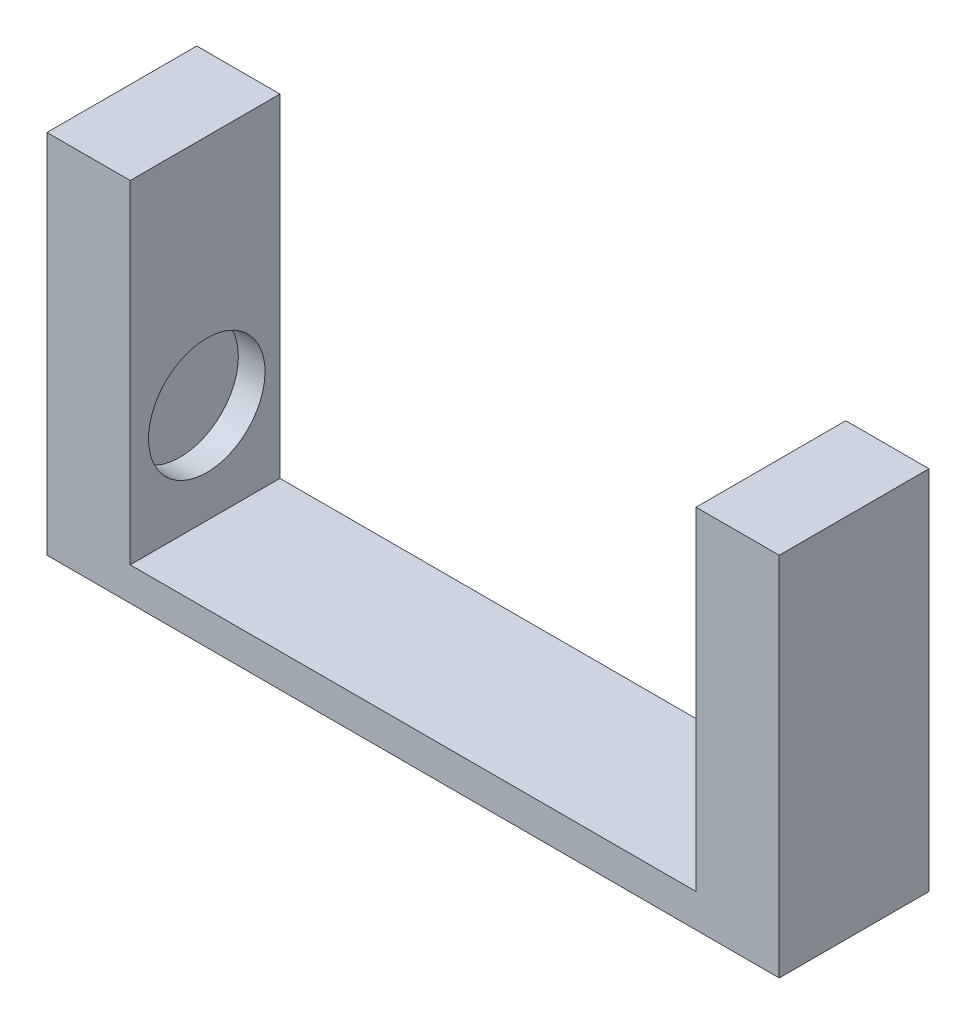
ISO-10303-21;
HEADER;
FILE_DESCRIPTION(('STEP AP214'),'2;1');
FILE_NAME('part.step','',(''),(''),'','','');
FILE_SCHEMA(('AUTOMOTIVE_DESIGN { 1 0 10303 214 1 1 1 1 }'));
ENDSEC;
DATA;
#1=APPLICATION_CONTEXT('core data for automotive mechanical design processes');
#2=APPLICATION_PROTOCOL_DEFINITION('international standard','automotive_design',2000,#1);
#3=PRODUCT_CONTEXT('',#1,'mechanical');
#4=PRODUCT('Part','Part','',(#3));
#5=PRODUCT_RELATED_PRODUCT_CATEGORY('part','',(#4));
#6=PRODUCT_DEFINITION_FORMATION('','',#4);
#7=PRODUCT_DEFINITION_CONTEXT('part definition',#1,'design');
#8=PRODUCT_DEFINITION('design','',#6,#7);
#9=PRODUCT_DEFINITION_SHAPE('','',#8);
#10=(LENGTH_UNIT() NAMED_UNIT(*) SI_UNIT(.MILLI.,.METRE.));
#11=(NAMED_UNIT(*) PLANE_ANGLE_UNIT() SI_UNIT($,.RADIAN.));
#12=(NAMED_UNIT(*) SI_UNIT($,.STERADIAN.) SOLID_ANGLE_UNIT());
#13=UNCERTAINTY_MEASURE_WITH_UNIT(LENGTH_MEASURE(1.E-05),#10,'distance_accuracy_value','');
#14=(GEOMETRIC_REPRESENTATION_CONTEXT(3) GLOBAL_UNCERTAINTY_ASSIGNED_CONTEXT((#13)) GLOBAL_UNIT_ASSIGNED_CONTEXT((#10,
#11,#12)) REPRESENTATION_CONTEXT('',''));
#15=CARTESIAN_POINT('',(0.,0.,0.));
#16=DIRECTION('',(0.,0.,1.));
#17=DIRECTION('',(1.,0.,0.));
#18=AXIS2_PLACEMENT_3D('',#15,#16,#17);
#19=CARTESIAN_POINT('',(0.,110.,45.));
#20=DIRECTION('',(0.,-1.,0.));
#21=DIRECTION('',(0.,0.,-1.));
#22=AXIS2_PLACEMENT_3D('',#19,#20,#21);
#23=PLANE('',#22);
#24=DIRECTION('',(-1.,0.,0.));
#25=VECTOR('',#24,1.);
#26=CARTESIAN_POINT('',(0.,110.,45.));
#27=LINE('',#26,#25);
#28=CARTESIAN_POINT('',(25.,110.,45.));
#29=VERTEX_POINT('',#28);
#30=CARTESIAN_POINT('',(0.,110.,45.));
#31=VERTEX_POINT('',#30);
#32=EDGE_CURVE('E56',#29,#31,#27,.T.);
#33=ORIENTED_EDGE('',*,*,#32,.F.);
#34=DIRECTION('',(0.,0.,1.));
#35=VECTOR('',#34,1.);
#36=CARTESIAN_POINT('',(25.,110.,-20.));
#37=LINE('',#36,#35);
#38=CARTESIAN_POINT('',(25.,110.,0.));
#39=VERTEX_POINT('',#38);
#40=EDGE_CURVE('E119',#39,#29,#37,.T.);
#41=ORIENTED_EDGE('',*,*,#40,.F.);
#42=DIRECTION('',(-1.,0.,0.));
#43=VECTOR('',#42,1.);
#44=CARTESIAN_POINT('',(0.,110.,0.));
#45=LINE('',#44,#43);
#46=CARTESIAN_POINT('',(0.,110.,0.));
#47=VERTEX_POINT('',#46);
#48=EDGE_CURVE('E78',#39,#47,#45,.T.);
#49=ORIENTED_EDGE('',*,*,#48,.T.);
#50=DIRECTION('',(0.,0.,-1.));
#51=VECTOR('',#50,1.);
#52=CARTESIAN_POINT('',(0.,110.,45.));
#53=LINE('',#52,#51);
#54=EDGE_CURVE('E142',#31,#47,#53,.T.);
#55=ORIENTED_EDGE('',*,*,#54,.F.);
#56=EDGE_LOOP('',(#33,#41,#49,#55));
#57=FACE_BOUND('',#56,.T.);
#58=ADVANCED_FACE('F32',(#57),#23,.F.);
#59=CARTESIAN_POINT('',(0.,0.,45.));
#60=DIRECTION('',(1.,0.,0.));
#61=DIRECTION('',(0.,0.,-1.));
#62=AXIS2_PLACEMENT_3D('',#59,#60,#61);
#63=PLANE('',#62);
#64=DIRECTION('',(0.,-1.,0.));
#65=VECTOR('',#64,1.);
#66=CARTESIAN_POINT('',(0.,0.,0.));
#67=LINE('',#66,#65);
#68=CARTESIAN_POINT('',(0.,0.,0.));
#69=VERTEX_POINT('',#68);
#70=EDGE_CURVE('E129',#47,#69,#67,.T.);
#71=ORIENTED_EDGE('',*,*,#70,.T.);
#72=DIRECTION('',(0.,0.,-1.));
#73=VECTOR('',#72,1.);
#74=CARTESIAN_POINT('',(0.,0.,45.));
#75=LINE('',#74,#73);
#76=CARTESIAN_POINT('',(0.,0.,45.));
#77=VERTEX_POINT('',#76);
#78=EDGE_CURVE('E158',#77,#69,#75,.T.);
#79=ORIENTED_EDGE('',*,*,#78,.F.);
#80=DIRECTION('',(0.,-1.,0.));
#81=VECTOR('',#80,1.);
#82=CARTESIAN_POINT('',(0.,0.,45.));
#83=LINE('',#82,#81);
#84=EDGE_CURVE('E134',#31,#77,#83,.T.);
#85=ORIENTED_EDGE('',*,*,#84,.F.);
#86=ORIENTED_EDGE('',*,*,#54,.T.);
#87=EDGE_LOOP('',(#71,#79,#85,#86));
#88=FACE_BOUND('',#87,.T.);
#89=ADVANCED_FACE('F34',(#88),#63,.F.);
#90=CARTESIAN_POINT('',(0.,0.,45.));
#91=DIRECTION('',(0.,1.,0.));
#92=DIRECTION('',(0.,0.,1.));
#93=AXIS2_PLACEMENT_3D('',#90,#91,#92);
#94=PLANE('',#93);
#95=DIRECTION('',(1.,0.,0.));
#96=VECTOR('',#95,1.);
#97=CARTESIAN_POINT('',(0.,0.,0.));
#98=LINE('',#97,#96);
#99=CARTESIAN_POINT('',(220.,0.,0.));
#100=VERTEX_POINT('',#99);
#101=EDGE_CURVE('E145',#69,#100,#98,.T.);
#102=ORIENTED_EDGE('',*,*,#101,.T.);
#103=DIRECTION('',(0.,0.,-1.));
#104=VECTOR('',#103,1.);
#105=CARTESIAN_POINT('',(220.,0.,45.));
#106=LINE('',#105,#104);
#107=CARTESIAN_POINT('',(220.,0.,45.));
#108=VERTEX_POINT('',#107);
#109=EDGE_CURVE('E155',#108,#100,#106,.T.);
#110=ORIENTED_EDGE('',*,*,#109,.F.);
#111=DIRECTION('',(1.,0.,0.));
#112=VECTOR('',#111,1.);
#113=CARTESIAN_POINT('',(0.,0.,45.));
#114=LINE('',#113,#112);
#115=EDGE_CURVE('E86',#77,#108,#114,.T.);
#116=ORIENTED_EDGE('',*,*,#115,.F.);
#117=ORIENTED_EDGE('',*,*,#78,.T.);
#118=EDGE_LOOP('',(#102,#110,#116,#117));
#119=FACE_BOUND('',#118,.T.);
#120=ADVANCED_FACE('F172',(#119),#94,.F.);
#121=CARTESIAN_POINT('',(220.,0.,45.));
#122=DIRECTION('',(-1.,0.,0.));
#123=DIRECTION('',(0.,0.,1.));
#124=AXIS2_PLACEMENT_3D('',#121,#122,#123);
#125=PLANE('',#124);
#126=DIRECTION('',(0.,1.,0.));
#127=VECTOR('',#126,1.);
#128=CARTESIAN_POINT('',(220.,0.,0.));
#129=LINE('',#128,#127);
#130=CARTESIAN_POINT('',(220.,110.,0.));
#131=VERTEX_POINT('',#130);
#132=EDGE_CURVE('E147',#100,#131,#129,.T.);
#133=ORIENTED_EDGE('',*,*,#132,.T.);
#134=DIRECTION('',(0.,0.,-1.));
#135=VECTOR('',#134,1.);
#136=CARTESIAN_POINT('',(220.,110.,45.));
#137=LINE('',#136,#135);
#138=CARTESIAN_POINT('',(220.,110.,45.));
#139=VERTEX_POINT('',#138);
#140=EDGE_CURVE('E152',#139,#131,#137,.T.);
#141=ORIENTED_EDGE('',*,*,#140,.F.);
#142=DIRECTION('',(0.,1.,0.));
#143=VECTOR('',#142,1.);
#144=CARTESIAN_POINT('',(220.,0.,45.));
#145=LINE('',#144,#143);
#146=EDGE_CURVE('E138',#108,#139,#145,.T.);
#147=ORIENTED_EDGE('',*,*,#146,.F.);
#148=ORIENTED_EDGE('',*,*,#109,.T.);
#149=EDGE_LOOP('',(#133,#141,#147,#148));
#150=FACE_BOUND('',#149,.T.);
#151=ADVANCED_FACE('F175',(#150),#125,.F.);
#152=CARTESIAN_POINT('',(195.,110.,0.));
#153=VERTEX_POINT('',#152);
#154=EDGE_CURVE('E136',#131,#153,#45,.T.);
#155=ORIENTED_EDGE('',*,*,#154,.T.);
#156=DIRECTION('',(0.,0.,1.));
#157=VECTOR('',#156,1.);
#158=CARTESIAN_POINT('',(195.,110.,-20.));
#159=LINE('',#158,#157);
#160=CARTESIAN_POINT('',(195.,110.,45.));
#161=VERTEX_POINT('',#160);
#162=EDGE_CURVE('E130',#153,#161,#159,.T.);
#163=ORIENTED_EDGE('',*,*,#162,.T.);
#164=EDGE_CURVE('E140',#139,#161,#27,.T.);
#165=ORIENTED_EDGE('',*,*,#164,.F.);
#166=ORIENTED_EDGE('',*,*,#140,.T.);
#167=EDGE_LOOP('',(#155,#163,#165,#166));
#168=FACE_BOUND('',#167,.T.);
#169=ADVANCED_FACE('F178',(#168),#23,.F.);
#170=CARTESIAN_POINT('',(0.,110.,45.));
#171=DIRECTION('',(0.,0.,-1.));
#172=DIRECTION('',(-1.,0.,0.));
#173=AXIS2_PLACEMENT_3D('',#170,#171,#172);
#174=PLANE('',#173);
#175=DIRECTION('',(1.,0.,0.));
#176=VECTOR('',#175,1.);
#177=CARTESIAN_POINT('',(25.,10.,45.));
#178=LINE('',#177,#176);
#179=CARTESIAN_POINT('',(25.,10.,45.));
#180=VERTEX_POINT('',#179);
#181=CARTESIAN_POINT('',(195.,9.99999999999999,45.));
#182=VERTEX_POINT('',#181);
#183=EDGE_CURVE('E109',#180,#182,#178,.T.);
#184=ORIENTED_EDGE('',*,*,#183,.F.);
#185=DIRECTION('',(0.,-1.,0.));
#186=VECTOR('',#185,1.);
#187=CARTESIAN_POINT('',(25.,110.,45.));
#188=LINE('',#187,#186);
#189=EDGE_CURVE('E117',#29,#180,#188,.T.);
#190=ORIENTED_EDGE('',*,*,#189,.F.);
#191=ORIENTED_EDGE('',*,*,#32,.T.);
#192=ORIENTED_EDGE('',*,*,#84,.T.);
#193=ORIENTED_EDGE('',*,*,#115,.T.);
#194=ORIENTED_EDGE('',*,*,#146,.T.);
#195=ORIENTED_EDGE('',*,*,#164,.T.);
#196=DIRECTION('',(0.,1.,0.));
#197=VECTOR('',#196,1.);
#198=CARTESIAN_POINT('',(195.,110.,45.));
#199=LINE('',#198,#197);
#200=EDGE_CURVE('E115',#182,#161,#199,.T.);
#201=ORIENTED_EDGE('',*,*,#200,.F.);
#202=EDGE_LOOP('',(#184,#190,#191,#192,#193,#194,#195,#201));
#203=FACE_BOUND('',#202,.T.);
#204=ADVANCED_FACE('F122',(#203),#174,.F.);
#205=CARTESIAN_POINT('',(0.,110.,0.));
#206=DIRECTION('',(0.,0.,-1.));
#207=DIRECTION('',(-1.,0.,0.));
#208=AXIS2_PLACEMENT_3D('',#205,#206,#207);
#209=PLANE('',#208);
#210=DIRECTION('',(0.,1.,0.));
#211=VECTOR('',#210,1.);
#212=CARTESIAN_POINT('',(25.,110.,0.));
#213=LINE('',#212,#211);
#214=CARTESIAN_POINT('',(25.,10.,0.));
#215=VERTEX_POINT('',#214);
#216=EDGE_CURVE('E11',#215,#39,#213,.T.);
#217=ORIENTED_EDGE('',*,*,#216,.F.);
#218=DIRECTION('',(-1.,0.,0.));
#219=VECTOR('',#218,1.);
#220=CARTESIAN_POINT('',(0.,9.99999999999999,0.));
#221=LINE('',#220,#219);
#222=CARTESIAN_POINT('',(195.,9.99999999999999,0.));
#223=VERTEX_POINT('',#222);
#224=EDGE_CURVE('E112',#223,#215,#221,.T.);
#225=ORIENTED_EDGE('',*,*,#224,.F.);
#226=DIRECTION('',(0.,-1.,0.));
#227=VECTOR('',#226,1.);
#228=CARTESIAN_POINT('',(195.,110.,0.));
#229=LINE('',#228,#227);
#230=EDGE_CURVE('E40',#153,#223,#229,.T.);
#231=ORIENTED_EDGE('',*,*,#230,.F.);
#232=ORIENTED_EDGE('',*,*,#154,.F.);
#233=ORIENTED_EDGE('',*,*,#132,.F.);
#234=ORIENTED_EDGE('',*,*,#101,.F.);
#235=ORIENTED_EDGE('',*,*,#70,.F.);
#236=ORIENTED_EDGE('',*,*,#48,.F.);
#237=EDGE_LOOP('',(#217,#225,#231,#232,#233,#234,#235,#236));
#238=FACE_BOUND('',#237,.T.);
#239=ADVANCED_FACE('F165',(#238),#209,.T.);
#240=CARTESIAN_POINT('',(25.,110.,-20.));
#241=DIRECTION('',(-1.,0.,0.));
#242=DIRECTION('',(0.,-1.,0.));
#243=AXIS2_PLACEMENT_3D('',#240,#241,#242);
#244=PLANE('',#243);
#245=CARTESIAN_POINT('',(25.,40.,22.));
#246=DIRECTION('',(1.,0.,0.));
#247=DIRECTION('',(0.,1.,0.));
#248=AXIS2_PLACEMENT_3D('',#245,#246,#247);
#249=CIRCLE('',#248,17.5);
#250=CARTESIAN_POINT('',(25.,57.5,22.));
#251=VERTEX_POINT('',#250);
#252=EDGE_CURVE('E296',#251,#251,#249,.T.);
#253=ORIENTED_EDGE('',*,*,#252,.F.);
#254=EDGE_LOOP('',(#253));
#255=FACE_BOUND('',#254,.T.);
#256=ORIENTED_EDGE('',*,*,#216,.T.);
#257=ORIENTED_EDGE('',*,*,#40,.T.);
#258=ORIENTED_EDGE('',*,*,#189,.T.);
#259=DIRECTION('',(0.,0.,1.));
#260=VECTOR('',#259,1.);
#261=CARTESIAN_POINT('',(25.,10.,-20.));
#262=LINE('',#261,#260);
#263=EDGE_CURVE('E105',#215,#180,#262,.T.);
#264=ORIENTED_EDGE('',*,*,#263,.F.);
#265=EDGE_LOOP('',(#256,#257,#258,#264));
#266=FACE_BOUND('',#265,.T.);
#267=ADVANCED_FACE('F118',(#255,#266),#244,.F.);
#268=CARTESIAN_POINT('',(195.,110.,-20.));
#269=DIRECTION('',(1.,0.,0.));
#270=DIRECTION('',(0.,0.,-1.));
#271=AXIS2_PLACEMENT_3D('',#268,#269,#270);
#272=PLANE('',#271);
#273=CARTESIAN_POINT('',(195.,40.,23.));
#274=DIRECTION('',(-1.,0.,0.));
#275=DIRECTION('',(0.,0.,1.));
#276=AXIS2_PLACEMENT_3D('',#273,#274,#275);
#277=CIRCLE('',#276,17.5);
#278=CARTESIAN_POINT('',(195.,40.,40.5));
#279=VERTEX_POINT('',#278);
#280=EDGE_CURVE('E295',#279,#279,#277,.T.);
#281=ORIENTED_EDGE('',*,*,#280,.F.);
#282=EDGE_LOOP('',(#281));
#283=FACE_BOUND('',#282,.T.);
#284=ORIENTED_EDGE('',*,*,#230,.T.);
#285=DIRECTION('',(0.,0.,1.));
#286=VECTOR('',#285,1.);
#287=CARTESIAN_POINT('',(195.,9.99999999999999,-20.));
#288=LINE('',#287,#286);
#289=EDGE_CURVE('E47',#223,#182,#288,.T.);
#290=ORIENTED_EDGE('',*,*,#289,.T.);
#291=ORIENTED_EDGE('',*,*,#200,.T.);
#292=ORIENTED_EDGE('',*,*,#162,.F.);
#293=EDGE_LOOP('',(#284,#290,#291,#292));
#294=FACE_BOUND('',#293,.T.);
#295=ADVANCED_FACE('F162',(#283,#294),#272,.F.);
#296=CARTESIAN_POINT('',(25.,10.,-20.));
#297=DIRECTION('',(0.,-1.,0.));
#298=DIRECTION('',(1.,0.,0.));
#299=AXIS2_PLACEMENT_3D('',#296,#297,#298);
#300=PLANE('',#299);
#301=ORIENTED_EDGE('',*,*,#224,.T.);
#302=ORIENTED_EDGE('',*,*,#263,.T.);
#303=ORIENTED_EDGE('',*,*,#183,.T.);
#304=ORIENTED_EDGE('',*,*,#289,.F.);
#305=EDGE_LOOP('',(#301,#302,#303,#304));
#306=FACE_BOUND('',#305,.T.);
#307=ADVANCED_FACE('F107',(#306),#300,.F.);
#308=CARTESIAN_POINT('',(203.,40.,23.));
#309=DIRECTION('',(-1.,0.,0.));
#310=DIRECTION('',(0.,0.,1.));
#311=AXIS2_PLACEMENT_3D('',#308,#309,#310);
#312=CYLINDRICAL_SURFACE('',#311,17.5);
#313=CARTESIAN_POINT('',(203.,40.,23.));
#314=DIRECTION('',(-1.,0.,0.));
#315=DIRECTION('',(0.,0.,1.));
#316=AXIS2_PLACEMENT_3D('',#313,#314,#315);
#317=CIRCLE('',#316,17.5);
#318=CARTESIAN_POINT('',(203.,40.,40.5));
#319=VERTEX_POINT('',#318);
#320=EDGE_CURVE('E120',#319,#319,#317,.T.);
#321=ORIENTED_EDGE('',*,*,#320,.F.);
#322=EDGE_LOOP('',(#321));
#323=FACE_BOUND('',#322,.T.);
#324=ORIENTED_EDGE('',*,*,#280,.T.);
#325=EDGE_LOOP('',(#324));
#326=FACE_BOUND('',#325,.T.);
#327=ADVANCED_FACE('F233',(#323,#326),#312,.F.);
#328=CARTESIAN_POINT('',(203.,40.,23.));
#329=DIRECTION('',(-1.,0.,0.));
#330=DIRECTION('',(0.,0.,1.));
#331=AXIS2_PLACEMENT_3D('',#328,#329,#330);
#332=PLANE('',#331);
#333=ORIENTED_EDGE('',*,*,#320,.T.);
#334=EDGE_LOOP('',(#333));
#335=FACE_BOUND('',#334,.T.);
#336=ADVANCED_FACE('F251',(#335),#332,.T.);
#337=CARTESIAN_POINT('',(17.,40.,22.));
#338=DIRECTION('',(1.,0.,0.));
#339=DIRECTION('',(0.,1.,0.));
#340=AXIS2_PLACEMENT_3D('',#337,#338,#339);
#341=CYLINDRICAL_SURFACE('',#340,17.5);
#342=CARTESIAN_POINT('',(17.,40.,22.));
#343=DIRECTION('',(1.,0.,0.));
#344=DIRECTION('',(0.,1.,0.));
#345=AXIS2_PLACEMENT_3D('',#342,#343,#344);
#346=CIRCLE('',#345,17.5);
#347=CARTESIAN_POINT('',(17.,57.5,22.));
#348=VERTEX_POINT('',#347);
#349=EDGE_CURVE('E294',#348,#348,#346,.T.);
#350=ORIENTED_EDGE('',*,*,#349,.F.);
#351=EDGE_LOOP('',(#350));
#352=FACE_BOUND('',#351,.T.);
#353=ORIENTED_EDGE('',*,*,#252,.T.);
#354=EDGE_LOOP('',(#353));
#355=FACE_BOUND('',#354,.T.);
#356=ADVANCED_FACE('F261',(#352,#355),#341,.F.);
#357=CARTESIAN_POINT('',(17.,40.,22.));
#358=DIRECTION('',(1.,0.,0.));
#359=DIRECTION('',(0.,1.,0.));
#360=AXIS2_PLACEMENT_3D('',#357,#358,#359);
#361=PLANE('',#360);
#362=ORIENTED_EDGE('',*,*,#349,.T.);
#363=EDGE_LOOP('',(#362));
#364=FACE_BOUND('',#363,.T.);
#365=ADVANCED_FACE('F278',(#364),#361,.T.);
#366=CLOSED_SHELL('',(#58,#89,#120,#151,#169,#204,#239,#267,#295,#307,#327,#336,#356,#365));
#367=MANIFOLD_SOLID_BREP('B2',#366);
#368=ADVANCED_BREP_SHAPE_REPRESENTATION('',(#18,#367),#14);
#369=SHAPE_DEFINITION_REPRESENTATION(#9,#368);
ENDSEC;
END-ISO-10303-21;
